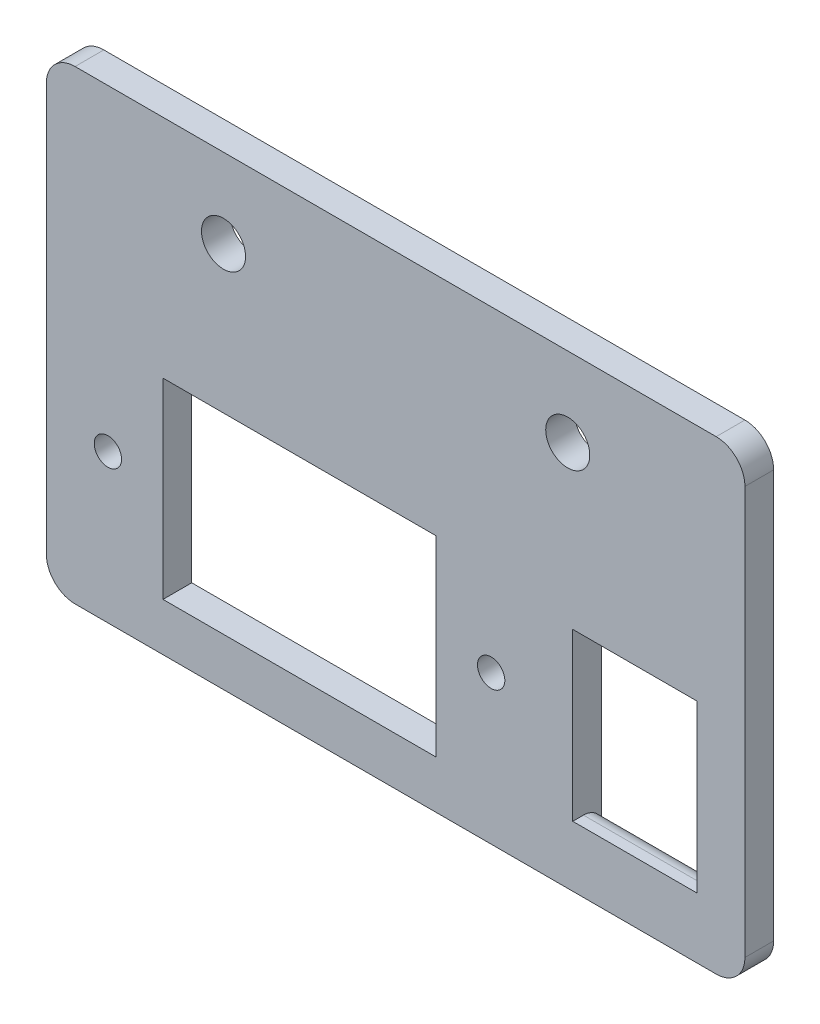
ISO-10303-21;
HEADER;
FILE_DESCRIPTION(('STEP AP214'),'2;1');
FILE_NAME('part.step','',(''),(''),'','','');
FILE_SCHEMA(('AUTOMOTIVE_DESIGN { 1 0 10303 214 1 1 1 1 }'));
ENDSEC;
DATA;
#1=APPLICATION_CONTEXT('core data for automotive mechanical design processes');
#2=APPLICATION_PROTOCOL_DEFINITION('international standard','automotive_design',2000,#1);
#3=PRODUCT_CONTEXT('',#1,'mechanical');
#4=PRODUCT('Part','Part','',(#3));
#5=PRODUCT_RELATED_PRODUCT_CATEGORY('part','',(#4));
#6=PRODUCT_DEFINITION_FORMATION('','',#4);
#7=PRODUCT_DEFINITION_CONTEXT('part definition',#1,'design');
#8=PRODUCT_DEFINITION('design','',#6,#7);
#9=PRODUCT_DEFINITION_SHAPE('','',#8);
#10=(LENGTH_UNIT() NAMED_UNIT(*) SI_UNIT(.MILLI.,.METRE.));
#11=(NAMED_UNIT(*) PLANE_ANGLE_UNIT() SI_UNIT($,.RADIAN.));
#12=(NAMED_UNIT(*) SI_UNIT($,.STERADIAN.) SOLID_ANGLE_UNIT());
#13=UNCERTAINTY_MEASURE_WITH_UNIT(LENGTH_MEASURE(1.E-05),#10,'distance_accuracy_value','');
#14=(GEOMETRIC_REPRESENTATION_CONTEXT(3) GLOBAL_UNCERTAINTY_ASSIGNED_CONTEXT((#13)) GLOBAL_UNIT_ASSIGNED_CONTEXT((#10,
#11,#12)) REPRESENTATION_CONTEXT('',''));
#15=CARTESIAN_POINT('',(0.,0.,0.));
#16=DIRECTION('',(0.,0.,1.));
#17=DIRECTION('',(1.,0.,0.));
#18=AXIS2_PLACEMENT_3D('',#15,#16,#17);
#19=CARTESIAN_POINT('',(0.529206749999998,8.67556,3.));
#20=DIRECTION('',(0.,1.,0.));
#21=DIRECTION('',(0.,0.,1.));
#22=AXIS2_PLACEMENT_3D('',#19,#20,#21);
#23=PLANE('',#22);
#24=DIRECTION('',(0.,0.,-1.));
#25=VECTOR('',#24,1.);
#26=CARTESIAN_POINT('',(19.014999,8.67556,3.));
#27=LINE('',#26,#25);
#28=CARTESIAN_POINT('',(19.014999,8.67556,3.));
#29=VERTEX_POINT('',#28);
#30=CARTESIAN_POINT('',(19.014999,8.67556,1.96442222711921));
#31=VERTEX_POINT('',#30);
#32=EDGE_CURVE('E233',#29,#31,#27,.T.);
#33=ORIENTED_EDGE('',*,*,#32,.T.);
#34=DIRECTION('',(1.,0.,0.));
#35=VECTOR('',#34,1.);
#36=CARTESIAN_POINT('',(0.529206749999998,8.67556,1.96442222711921));
#37=LINE('',#36,#35);
#38=CARTESIAN_POINT('',(31.985001,8.67556,1.96442222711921));
#39=VERTEX_POINT('',#38);
#40=EDGE_CURVE('E207',#31,#39,#37,.T.);
#41=ORIENTED_EDGE('',*,*,#40,.T.);
#42=DIRECTION('',(0.,0.,-1.));
#43=VECTOR('',#42,1.);
#44=CARTESIAN_POINT('',(31.985001,8.67556,3.));
#45=LINE('',#44,#43);
#46=CARTESIAN_POINT('',(31.985001,8.67556,3.));
#47=VERTEX_POINT('',#46);
#48=EDGE_CURVE('E418',#47,#39,#45,.T.);
#49=ORIENTED_EDGE('',*,*,#48,.F.);
#50=DIRECTION('',(1.,0.,0.));
#51=VECTOR('',#50,1.);
#52=CARTESIAN_POINT('',(0.529206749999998,8.67556,3.));
#53=LINE('',#52,#51);
#54=EDGE_CURVE('E276',#29,#47,#53,.T.);
#55=ORIENTED_EDGE('',*,*,#54,.F.);
#56=EDGE_LOOP('',(#33,#41,#49,#55));
#57=FACE_BOUND('',#56,.T.);
#58=ADVANCED_FACE('F35',(#57),#23,.F.);
#59=CARTESIAN_POINT('',(31.985001,-58.9988552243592,3.));
#60=DIRECTION('',(1.,0.,0.));
#61=DIRECTION('',(0.,1.,0.));
#62=AXIS2_PLACEMENT_3D('',#59,#60,#61);
#63=PLANE('',#62);
#64=CARTESIAN_POINT('',(31.985001,10.67556,1.96442222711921));
#65=DIRECTION('',(1.,0.,0.));
#66=DIRECTION('',(0.,1.,0.));
#67=AXIS2_PLACEMENT_3D('',#64,#65,#66);
#68=CIRCLE('',#67,2.);
#69=CARTESIAN_POINT('',(31.985001,10.3,0.));
#70=VERTEX_POINT('',#69);
#71=EDGE_CURVE('E210',#39,#70,#68,.T.);
#72=ORIENTED_EDGE('',*,*,#71,.T.);
#73=DIRECTION('',(0.,-1.,0.));
#74=VECTOR('',#73,1.);
#75=CARTESIAN_POINT('',(31.985001,-58.9988552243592,0.));
#76=LINE('',#75,#74);
#77=CARTESIAN_POINT('',(31.985001,-10.,0.));
#78=VERTEX_POINT('',#77);
#79=EDGE_CURVE('E308',#70,#78,#76,.T.);
#80=ORIENTED_EDGE('',*,*,#79,.T.);
#81=CARTESIAN_POINT('',(31.985001,-10.67556,1.88245018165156));
#82=DIRECTION('',(1.,0.,0.));
#83=DIRECTION('',(0.,1.,0.));
#84=AXIS2_PLACEMENT_3D('',#81,#82,#83);
#85=CIRCLE('',#84,2.);
#86=CARTESIAN_POINT('',(31.985001,-8.67556,1.88245018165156));
#87=VERTEX_POINT('',#86);
#88=EDGE_CURVE('E43',#78,#87,#85,.T.);
#89=ORIENTED_EDGE('',*,*,#88,.T.);
#90=DIRECTION('',(0.,0.,-1.));
#91=VECTOR('',#90,1.);
#92=CARTESIAN_POINT('',(31.985001,-8.67556,3.));
#93=LINE('',#92,#91);
#94=CARTESIAN_POINT('',(31.985001,-8.67556,3.));
#95=VERTEX_POINT('',#94);
#96=EDGE_CURVE('E223',#95,#87,#93,.T.);
#97=ORIENTED_EDGE('',*,*,#96,.F.);
#98=DIRECTION('',(0.,-1.,0.));
#99=VECTOR('',#98,1.);
#100=CARTESIAN_POINT('',(31.985001,-58.9988552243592,3.));
#101=LINE('',#100,#99);
#102=EDGE_CURVE('E279',#47,#95,#101,.T.);
#103=ORIENTED_EDGE('',*,*,#102,.F.);
#104=ORIENTED_EDGE('',*,*,#48,.T.);
#105=EDGE_LOOP('',(#72,#80,#89,#97,#103,#104));
#106=FACE_BOUND('',#105,.T.);
#107=ADVANCED_FACE('F342',(#106),#63,.F.);
#108=CARTESIAN_POINT('',(0.529206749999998,-8.67556,3.));
#109=DIRECTION('',(0.,1.,0.));
#110=DIRECTION('',(0.,0.,1.));
#111=AXIS2_PLACEMENT_3D('',#108,#109,#110);
#112=PLANE('',#111);
#113=ORIENTED_EDGE('',*,*,#96,.T.);
#114=DIRECTION('',(1.,0.,0.));
#115=VECTOR('',#114,1.);
#116=CARTESIAN_POINT('',(19.014999,-8.67556,1.88245018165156));
#117=LINE('',#116,#115);
#118=CARTESIAN_POINT('',(19.014999,-8.67556,1.88245018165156));
#119=VERTEX_POINT('',#118);
#120=EDGE_CURVE('E215',#87,#119,#117,.F.);
#121=ORIENTED_EDGE('',*,*,#120,.T.);
#122=DIRECTION('',(0.,0.,-1.));
#123=VECTOR('',#122,1.);
#124=CARTESIAN_POINT('',(19.014999,-8.67556,3.));
#125=LINE('',#124,#123);
#126=CARTESIAN_POINT('',(19.014999,-8.67556,3.));
#127=VERTEX_POINT('',#126);
#128=EDGE_CURVE('E221',#127,#119,#125,.T.);
#129=ORIENTED_EDGE('',*,*,#128,.F.);
#130=DIRECTION('',(1.,0.,0.));
#131=VECTOR('',#130,1.);
#132=CARTESIAN_POINT('',(0.529206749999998,-8.67556,3.));
#133=LINE('',#132,#131);
#134=EDGE_CURVE('E281',#127,#95,#133,.T.);
#135=ORIENTED_EDGE('',*,*,#134,.T.);
#136=EDGE_LOOP('',(#113,#121,#129,#135));
#137=FACE_BOUND('',#136,.T.);
#138=ADVANCED_FACE('F219',(#137),#112,.T.);
#139=CARTESIAN_POINT('',(0.529206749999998,9.99999999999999,3.));
#140=DIRECTION('',(0.,1.,0.));
#141=DIRECTION('',(0.,0.,1.));
#142=AXIS2_PLACEMENT_3D('',#139,#140,#141);
#143=PLANE('',#142);
#144=DIRECTION('',(1.,0.,0.));
#145=VECTOR('',#144,1.);
#146=CARTESIAN_POINT('',(0.529206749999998,9.99999999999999,0.));
#147=LINE('',#146,#145);
#148=CARTESIAN_POINT('',(-23.75,9.99999999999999,0.));
#149=VERTEX_POINT('',#148);
#150=CARTESIAN_POINT('',(4.75,9.99999999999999,0.));
#151=VERTEX_POINT('',#150);
#152=EDGE_CURVE('E428',#149,#151,#147,.T.);
#153=ORIENTED_EDGE('',*,*,#152,.T.);
#154=DIRECTION('',(0.,0.,-1.));
#155=VECTOR('',#154,1.);
#156=CARTESIAN_POINT('',(4.75,9.99999999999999,3.));
#157=LINE('',#156,#155);
#158=CARTESIAN_POINT('',(4.75,9.99999999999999,3.));
#159=VERTEX_POINT('',#158);
#160=EDGE_CURVE('E409',#159,#151,#157,.T.);
#161=ORIENTED_EDGE('',*,*,#160,.F.);
#162=DIRECTION('',(1.,0.,0.));
#163=VECTOR('',#162,1.);
#164=CARTESIAN_POINT('',(0.529206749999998,9.99999999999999,3.));
#165=LINE('',#164,#163);
#166=CARTESIAN_POINT('',(-23.75,9.99999999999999,3.));
#167=VERTEX_POINT('',#166);
#168=EDGE_CURVE('E265',#167,#159,#165,.T.);
#169=ORIENTED_EDGE('',*,*,#168,.F.);
#170=DIRECTION('',(0.,0.,-1.));
#171=VECTOR('',#170,1.);
#172=CARTESIAN_POINT('',(-23.75,9.99999999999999,3.));
#173=LINE('',#172,#171);
#174=EDGE_CURVE('E284',#167,#149,#173,.T.);
#175=ORIENTED_EDGE('',*,*,#174,.T.);
#176=EDGE_LOOP('',(#153,#161,#169,#175));
#177=FACE_BOUND('',#176,.T.);
#178=ADVANCED_FACE('F365',(#177),#143,.F.);
#179=CARTESIAN_POINT('',(4.75000000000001,-58.9988552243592,3.));
#180=DIRECTION('',(1.,0.,0.));
#181=DIRECTION('',(0.,1.,0.));
#182=AXIS2_PLACEMENT_3D('',#179,#180,#181);
#183=PLANE('',#182);
#184=DIRECTION('',(0.,-1.,0.));
#185=VECTOR('',#184,1.);
#186=CARTESIAN_POINT('',(4.75000000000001,-58.9988552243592,0.));
#187=LINE('',#186,#185);
#188=CARTESIAN_POINT('',(4.75,-10.,0.));
#189=VERTEX_POINT('',#188);
#190=EDGE_CURVE('E433',#151,#189,#187,.T.);
#191=ORIENTED_EDGE('',*,*,#190,.T.);
#192=DIRECTION('',(0.,0.,-1.));
#193=VECTOR('',#192,1.);
#194=CARTESIAN_POINT('',(4.75,-10.,3.));
#195=LINE('',#194,#193);
#196=CARTESIAN_POINT('',(4.75,-10.,3.));
#197=VERTEX_POINT('',#196);
#198=EDGE_CURVE('E412',#197,#189,#195,.T.);
#199=ORIENTED_EDGE('',*,*,#198,.F.);
#200=DIRECTION('',(0.,-1.,0.));
#201=VECTOR('',#200,1.);
#202=CARTESIAN_POINT('',(4.75000000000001,-58.9988552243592,3.));
#203=LINE('',#202,#201);
#204=EDGE_CURVE('E268',#159,#197,#203,.T.);
#205=ORIENTED_EDGE('',*,*,#204,.F.);
#206=ORIENTED_EDGE('',*,*,#160,.T.);
#207=EDGE_LOOP('',(#191,#199,#205,#206));
#208=FACE_BOUND('',#207,.T.);
#209=ADVANCED_FACE('F361',(#208),#183,.F.);
#210=CARTESIAN_POINT('',(0.529206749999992,-10.,3.));
#211=DIRECTION('',(0.,1.,0.));
#212=DIRECTION('',(-1.,0.,0.));
#213=AXIS2_PLACEMENT_3D('',#210,#211,#212);
#214=PLANE('',#213);
#215=DIRECTION('',(1.,0.,0.));
#216=VECTOR('',#215,1.);
#217=CARTESIAN_POINT('',(0.529206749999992,-10.,0.));
#218=LINE('',#217,#216);
#219=CARTESIAN_POINT('',(-23.75,-10.,0.));
#220=VERTEX_POINT('',#219);
#221=EDGE_CURVE('E170',#220,#189,#218,.T.);
#222=ORIENTED_EDGE('',*,*,#221,.F.);
#223=DIRECTION('',(0.,0.,-1.));
#224=VECTOR('',#223,1.);
#225=CARTESIAN_POINT('',(-23.75,-10.,3.));
#226=LINE('',#225,#224);
#227=CARTESIAN_POINT('',(-23.75,-10.,3.));
#228=VERTEX_POINT('',#227);
#229=EDGE_CURVE('E422',#228,#220,#226,.T.);
#230=ORIENTED_EDGE('',*,*,#229,.F.);
#231=DIRECTION('',(1.,0.,0.));
#232=VECTOR('',#231,1.);
#233=CARTESIAN_POINT('',(0.529206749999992,-10.,3.));
#234=LINE('',#233,#232);
#235=EDGE_CURVE('E270',#228,#197,#234,.T.);
#236=ORIENTED_EDGE('',*,*,#235,.T.);
#237=ORIENTED_EDGE('',*,*,#198,.T.);
#238=EDGE_LOOP('',(#222,#230,#236,#237));
#239=FACE_BOUND('',#238,.T.);
#240=ADVANCED_FACE('F358',(#239),#214,.T.);
#241=CARTESIAN_POINT('',(36.985001,-58.9988552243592,3.));
#242=DIRECTION('',(1.,0.,0.));
#243=DIRECTION('',(0.,0.,-1.));
#244=AXIS2_PLACEMENT_3D('',#241,#242,#243);
#245=PLANE('',#244);
#246=DIRECTION('',(0.,0.,-1.));
#247=VECTOR('',#246,1.);
#248=CARTESIAN_POINT('',(36.985001,-12.,3.));
#249=LINE('',#248,#247);
#250=CARTESIAN_POINT('',(36.985001,-12.,3.));
#251=VERTEX_POINT('',#250);
#252=CARTESIAN_POINT('',(36.985001,-12.,0.));
#253=VERTEX_POINT('',#252);
#254=EDGE_CURVE('E189',#251,#253,#249,.T.);
#255=ORIENTED_EDGE('',*,*,#254,.T.);
#256=DIRECTION('',(0.,-1.,0.));
#257=VECTOR('',#256,1.);
#258=CARTESIAN_POINT('',(36.985001,-58.9988552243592,0.));
#259=LINE('',#258,#257);
#260=CARTESIAN_POINT('',(36.985001,30.5776,0.));
#261=VERTEX_POINT('',#260);
#262=EDGE_CURVE('E50',#261,#253,#259,.T.);
#263=ORIENTED_EDGE('',*,*,#262,.F.);
#264=DIRECTION('',(0.,0.,-1.));
#265=VECTOR('',#264,1.);
#266=CARTESIAN_POINT('',(36.985001,30.5776,3.));
#267=LINE('',#266,#265);
#268=CARTESIAN_POINT('',(36.985001,30.5776,3.));
#269=VERTEX_POINT('',#268);
#270=EDGE_CURVE('E298',#261,#269,#267,.F.);
#271=ORIENTED_EDGE('',*,*,#270,.T.);
#272=DIRECTION('',(0.,-1.,0.));
#273=VECTOR('',#272,1.);
#274=CARTESIAN_POINT('',(36.985001,-58.9988552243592,3.));
#275=LINE('',#274,#273);
#276=EDGE_CURVE('E255',#269,#251,#275,.T.);
#277=ORIENTED_EDGE('',*,*,#276,.T.);
#278=EDGE_LOOP('',(#255,#263,#271,#277));
#279=FACE_BOUND('',#278,.T.);
#280=ADVANCED_FACE('F302',(#279),#245,.T.);
#281=CARTESIAN_POINT('',(0.529206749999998,33.5776,3.));
#282=DIRECTION('',(0.,1.,0.));
#283=DIRECTION('',(0.,0.,1.));
#284=AXIS2_PLACEMENT_3D('',#281,#282,#283);
#285=PLANE('',#284);
#286=DIRECTION('',(1.,0.,0.));
#287=VECTOR('',#286,1.);
#288=CARTESIAN_POINT('',(0.529206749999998,33.5776,3.));
#289=LINE('',#288,#287);
#290=CARTESIAN_POINT('',(-32.9265875,33.5776,3.));
#291=VERTEX_POINT('',#290);
#292=CARTESIAN_POINT('',(33.985001,33.5776,3.));
#293=VERTEX_POINT('',#292);
#294=EDGE_CURVE('E258',#291,#293,#289,.T.);
#295=ORIENTED_EDGE('',*,*,#294,.T.);
#296=DIRECTION('',(0.,0.,-1.));
#297=VECTOR('',#296,1.);
#298=CARTESIAN_POINT('',(33.985001,33.5776,3.));
#299=LINE('',#298,#297);
#300=CARTESIAN_POINT('',(33.985001,33.5776,0.));
#301=VERTEX_POINT('',#300);
#302=EDGE_CURVE('E200',#293,#301,#299,.T.);
#303=ORIENTED_EDGE('',*,*,#302,.T.);
#304=DIRECTION('',(1.,0.,0.));
#305=VECTOR('',#304,1.);
#306=CARTESIAN_POINT('',(0.529206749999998,33.5776,0.));
#307=LINE('',#306,#305);
#308=CARTESIAN_POINT('',(-32.9265875,33.5776,0.));
#309=VERTEX_POINT('',#308);
#310=EDGE_CURVE('E292',#309,#301,#307,.T.);
#311=ORIENTED_EDGE('',*,*,#310,.F.);
#312=DIRECTION('',(0.,0.,-1.));
#313=VECTOR('',#312,1.);
#314=CARTESIAN_POINT('',(-32.9265875,33.5776,3.));
#315=LINE('',#314,#313);
#316=EDGE_CURVE('E198',#309,#291,#315,.F.);
#317=ORIENTED_EDGE('',*,*,#316,.T.);
#318=EDGE_LOOP('',(#295,#303,#311,#317));
#319=FACE_BOUND('',#318,.T.);
#320=ADVANCED_FACE('F375',(#319),#285,.T.);
#321=CARTESIAN_POINT('',(-35.9265875,-58.9988552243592,3.));
#322=DIRECTION('',(-1.,0.,0.));
#323=DIRECTION('',(0.,0.,1.));
#324=AXIS2_PLACEMENT_3D('',#321,#322,#323);
#325=PLANE('',#324);
#326=DIRECTION('',(0.,1.,0.));
#327=VECTOR('',#326,1.);
#328=CARTESIAN_POINT('',(-35.9265875,-58.9988552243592,0.));
#329=LINE('',#328,#327);
#330=CARTESIAN_POINT('',(-35.9265875,-12.,0.));
#331=VERTEX_POINT('',#330);
#332=CARTESIAN_POINT('',(-35.9265875,30.5776,0.));
#333=VERTEX_POINT('',#332);
#334=EDGE_CURVE('E427',#331,#333,#329,.T.);
#335=ORIENTED_EDGE('',*,*,#334,.F.);
#336=DIRECTION('',(0.,0.,-1.));
#337=VECTOR('',#336,1.);
#338=CARTESIAN_POINT('',(-35.9265875,-12.,3.));
#339=LINE('',#338,#337);
#340=CARTESIAN_POINT('',(-35.9265875,-12.,3.));
#341=VERTEX_POINT('',#340);
#342=EDGE_CURVE('E177',#331,#341,#339,.F.);
#343=ORIENTED_EDGE('',*,*,#342,.T.);
#344=DIRECTION('',(0.,1.,0.));
#345=VECTOR('',#344,1.);
#346=CARTESIAN_POINT('',(-35.9265875,-58.9988552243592,3.));
#347=LINE('',#346,#345);
#348=CARTESIAN_POINT('',(-35.9265875,30.5776,3.));
#349=VERTEX_POINT('',#348);
#350=EDGE_CURVE('E261',#341,#349,#347,.T.);
#351=ORIENTED_EDGE('',*,*,#350,.T.);
#352=DIRECTION('',(0.,0.,-1.));
#353=VECTOR('',#352,1.);
#354=CARTESIAN_POINT('',(-35.9265875,30.5776,3.));
#355=LINE('',#354,#353);
#356=EDGE_CURVE('E420',#349,#333,#355,.T.);
#357=ORIENTED_EDGE('',*,*,#356,.T.);
#358=EDGE_LOOP('',(#335,#343,#351,#357));
#359=FACE_BOUND('',#358,.T.);
#360=ADVANCED_FACE('F356',(#359),#325,.T.);
#361=CARTESIAN_POINT('',(-23.75,-58.9988552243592,3.));
#362=DIRECTION('',(1.,0.,0.));
#363=DIRECTION('',(0.,0.,-1.));
#364=AXIS2_PLACEMENT_3D('',#361,#362,#363);
#365=PLANE('',#364);
#366=DIRECTION('',(0.,-1.,0.));
#367=VECTOR('',#366,1.);
#368=CARTESIAN_POINT('',(-23.75,-58.9988552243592,0.));
#369=LINE('',#368,#367);
#370=EDGE_CURVE('E435',#149,#220,#369,.T.);
#371=ORIENTED_EDGE('',*,*,#370,.F.);
#372=ORIENTED_EDGE('',*,*,#174,.F.);
#373=DIRECTION('',(0.,-1.,0.));
#374=VECTOR('',#373,1.);
#375=CARTESIAN_POINT('',(-23.75,-58.9988552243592,3.));
#376=LINE('',#375,#374);
#377=EDGE_CURVE('E273',#167,#228,#376,.T.);
#378=ORIENTED_EDGE('',*,*,#377,.T.);
#379=ORIENTED_EDGE('',*,*,#229,.T.);
#380=EDGE_LOOP('',(#371,#372,#378,#379));
#381=FACE_BOUND('',#380,.T.);
#382=ADVANCED_FACE('F353',(#381),#365,.T.);
#383=CARTESIAN_POINT('',(0.529206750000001,-15.,3.));
#384=DIRECTION('',(0.,-1.,0.));
#385=DIRECTION('',(1.,0.,0.));
#386=AXIS2_PLACEMENT_3D('',#383,#384,#385);
#387=PLANE('',#386);
#388=DIRECTION('',(1.,0.,0.));
#389=VECTOR('',#388,1.);
#390=CARTESIAN_POINT('',(-40.014999,-15.,0.));
#391=LINE('',#390,#389);
#392=CARTESIAN_POINT('',(-32.9265875,-15.,0.));
#393=VERTEX_POINT('',#392);
#394=CARTESIAN_POINT('',(33.985001,-15.,0.));
#395=VERTEX_POINT('',#394);
#396=EDGE_CURVE('E160',#393,#395,#391,.T.);
#397=ORIENTED_EDGE('',*,*,#396,.T.);
#398=DIRECTION('',(0.,0.,-1.));
#399=VECTOR('',#398,1.);
#400=CARTESIAN_POINT('',(33.985001,-15.,3.));
#401=LINE('',#400,#399);
#402=CARTESIAN_POINT('',(33.985001,-15.,3.));
#403=VERTEX_POINT('',#402);
#404=EDGE_CURVE('E185',#395,#403,#401,.F.);
#405=ORIENTED_EDGE('',*,*,#404,.T.);
#406=DIRECTION('',(-1.,0.,0.));
#407=VECTOR('',#406,1.);
#408=CARTESIAN_POINT('',(0.529206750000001,-15.,3.));
#409=LINE('',#408,#407);
#410=CARTESIAN_POINT('',(-32.9265875,-15.,3.));
#411=VERTEX_POINT('',#410);
#412=EDGE_CURVE('E183',#403,#411,#409,.T.);
#413=ORIENTED_EDGE('',*,*,#412,.T.);
#414=DIRECTION('',(0.,0.,-1.));
#415=VECTOR('',#414,1.);
#416=CARTESIAN_POINT('',(-32.9265875,-15.,3.));
#417=LINE('',#416,#415);
#418=EDGE_CURVE('E176',#411,#393,#417,.T.);
#419=ORIENTED_EDGE('',*,*,#418,.T.);
#420=EDGE_LOOP('',(#397,#405,#413,#419));
#421=FACE_BOUND('',#420,.T.);
#422=ADVANCED_FACE('F181',(#421),#387,.T.);
#423=CARTESIAN_POINT('',(10.5,0.4999975,3.));
#424=DIRECTION('',(0.,0.,-1.));
#425=DIRECTION('',(-1.,0.,0.));
#426=AXIS2_PLACEMENT_3D('',#423,#424,#425);
#427=CYLINDRICAL_SURFACE('',#426,1.4265825);
#428=CARTESIAN_POINT('',(10.5,0.4999975,3.));
#429=DIRECTION('',(0.,0.,1.));
#430=DIRECTION('',(1.,0.,0.));
#431=AXIS2_PLACEMENT_3D('',#428,#429,#430);
#432=CIRCLE('',#431,1.4265825);
#433=CARTESIAN_POINT('',(11.9265825,0.4999975,3.));
#434=VERTEX_POINT('',#433);
#435=EDGE_CURVE('E251',#434,#434,#432,.T.);
#436=ORIENTED_EDGE('',*,*,#435,.T.);
#437=EDGE_LOOP('',(#436));
#438=FACE_BOUND('',#437,.T.);
#439=CARTESIAN_POINT('',(10.5,0.4999975,0.));
#440=DIRECTION('',(0.,0.,1.));
#441=DIRECTION('',(1.,0.,0.));
#442=AXIS2_PLACEMENT_3D('',#439,#440,#441);
#443=CIRCLE('',#442,1.4265825);
#444=CARTESIAN_POINT('',(11.9265825,0.4999975,0.));
#445=VERTEX_POINT('',#444);
#446=EDGE_CURVE('E287',#445,#445,#443,.T.);
#447=ORIENTED_EDGE('',*,*,#446,.F.);
#448=EDGE_LOOP('',(#447));
#449=FACE_BOUND('',#448,.T.);
#450=ADVANCED_FACE('F372',(#438,#449),#427,.F.);
#451=CARTESIAN_POINT('',(-29.5,0.5000025,3.));
#452=DIRECTION('',(0.,0.,-1.));
#453=DIRECTION('',(-1.,0.,0.));
#454=AXIS2_PLACEMENT_3D('',#451,#452,#453);
#455=CYLINDRICAL_SURFACE('',#454,1.4265875);
#456=CARTESIAN_POINT('',(-29.5,0.5000025,3.));
#457=DIRECTION('',(0.,0.,1.));
#458=DIRECTION('',(1.,0.,0.));
#459=AXIS2_PLACEMENT_3D('',#456,#457,#458);
#460=CIRCLE('',#459,1.4265875);
#461=CARTESIAN_POINT('',(-28.0734125,0.5000025,3.));
#462=VERTEX_POINT('',#461);
#463=EDGE_CURVE('E248',#462,#462,#460,.T.);
#464=ORIENTED_EDGE('',*,*,#463,.T.);
#465=EDGE_LOOP('',(#464));
#466=FACE_BOUND('',#465,.T.);
#467=CARTESIAN_POINT('',(-29.5,0.5000025,0.));
#468=DIRECTION('',(0.,0.,1.));
#469=DIRECTION('',(1.,0.,0.));
#470=AXIS2_PLACEMENT_3D('',#467,#468,#469);
#471=CIRCLE('',#470,1.4265875);
#472=CARTESIAN_POINT('',(-28.0734125,0.5000025,0.));
#473=VERTEX_POINT('',#472);
#474=EDGE_CURVE('E241',#473,#473,#471,.T.);
#475=ORIENTED_EDGE('',*,*,#474,.F.);
#476=EDGE_LOOP('',(#475));
#477=FACE_BOUND('',#476,.T.);
#478=ADVANCED_FACE('F384',(#466,#477),#455,.F.);
#479=CARTESIAN_POINT('',(19.014999,-58.9988552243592,3.));
#480=DIRECTION('',(1.,0.,0.));
#481=DIRECTION('',(0.,1.,0.));
#482=AXIS2_PLACEMENT_3D('',#479,#480,#481);
#483=PLANE('',#482);
#484=DIRECTION('',(0.,-1.,0.));
#485=VECTOR('',#484,1.);
#486=CARTESIAN_POINT('',(19.014999,-58.9988552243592,0.));
#487=LINE('',#486,#485);
#488=CARTESIAN_POINT('',(19.014999,10.3,0.));
#489=VERTEX_POINT('',#488);
#490=CARTESIAN_POINT('',(19.014999,-10.,0.));
#491=VERTEX_POINT('',#490);
#492=EDGE_CURVE('E252',#489,#491,#487,.T.);
#493=ORIENTED_EDGE('',*,*,#492,.F.);
#494=CARTESIAN_POINT('',(19.014999,10.67556,1.96442222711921));
#495=DIRECTION('',(1.,0.,0.));
#496=DIRECTION('',(0.,1.,0.));
#497=AXIS2_PLACEMENT_3D('',#494,#495,#496);
#498=CIRCLE('',#497,2.);
#499=EDGE_CURVE('E213',#489,#31,#498,.F.);
#500=ORIENTED_EDGE('',*,*,#499,.T.);
#501=ORIENTED_EDGE('',*,*,#32,.F.);
#502=DIRECTION('',(0.,-1.,0.));
#503=VECTOR('',#502,1.);
#504=CARTESIAN_POINT('',(19.014999,-58.9988552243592,3.));
#505=LINE('',#504,#503);
#506=EDGE_CURVE('E232',#29,#127,#505,.T.);
#507=ORIENTED_EDGE('',*,*,#506,.T.);
#508=ORIENTED_EDGE('',*,*,#128,.T.);
#509=CARTESIAN_POINT('',(19.014999,-10.67556,1.88245018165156));
#510=DIRECTION('',(1.,0.,0.));
#511=DIRECTION('',(0.,1.,0.));
#512=AXIS2_PLACEMENT_3D('',#509,#510,#511);
#513=CIRCLE('',#512,2.);
#514=EDGE_CURVE('E11',#119,#491,#513,.F.);
#515=ORIENTED_EDGE('',*,*,#514,.T.);
#516=EDGE_LOOP('',(#493,#500,#501,#507,#508,#515));
#517=FACE_BOUND('',#516,.T.);
#518=ADVANCED_FACE('F229',(#517),#483,.T.);
#519=CARTESIAN_POINT('',(0.529206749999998,-58.9988552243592,3.));
#520=DIRECTION('',(0.,0.,1.));
#521=DIRECTION('',(1.,0.,0.));
#522=AXIS2_PLACEMENT_3D('',#519,#520,#521);
#523=PLANE('',#522);
#524=CARTESIAN_POINT('',(-17.434087,25.3,3.));
#525=DIRECTION('',(0.,0.,-1.));
#526=DIRECTION('',(1.,0.,0.));
#527=AXIS2_PLACEMENT_3D('',#524,#525,#526);
#528=CIRCLE('',#527,2.3);
#529=CARTESIAN_POINT('',(-15.134087,25.3,3.));
#530=VERTEX_POINT('',#529);
#531=EDGE_CURVE('E313',#530,#530,#528,.T.);
#532=ORIENTED_EDGE('',*,*,#531,.T.);
#533=EDGE_LOOP('',(#532));
#534=FACE_BOUND('',#533,.T.);
#535=CARTESIAN_POINT('',(18.4925005,25.3,3.));
#536=DIRECTION('',(0.,0.,-1.));
#537=DIRECTION('',(-1.,0.,0.));
#538=AXIS2_PLACEMENT_3D('',#535,#536,#537);
#539=CIRCLE('',#538,2.3);
#540=CARTESIAN_POINT('',(16.1925005,25.3,3.));
#541=VERTEX_POINT('',#540);
#542=EDGE_CURVE('E238',#541,#541,#539,.T.);
#543=ORIENTED_EDGE('',*,*,#542,.T.);
#544=EDGE_LOOP('',(#543));
#545=FACE_BOUND('',#544,.T.);
#546=ORIENTED_EDGE('',*,*,#463,.F.);
#547=EDGE_LOOP('',(#546));
#548=FACE_BOUND('',#547,.T.);
#549=ORIENTED_EDGE('',*,*,#435,.F.);
#550=EDGE_LOOP('',(#549));
#551=FACE_BOUND('',#550,.T.);
#552=ORIENTED_EDGE('',*,*,#350,.F.);
#553=CARTESIAN_POINT('',(-32.9265875,-12.,3.));
#554=DIRECTION('',(0.,0.,1.));
#555=DIRECTION('',(1.,0.,0.));
#556=AXIS2_PLACEMENT_3D('',#553,#554,#555);
#557=CIRCLE('',#556,3.);
#558=EDGE_CURVE('E196',#341,#411,#557,.T.);
#559=ORIENTED_EDGE('',*,*,#558,.T.);
#560=ORIENTED_EDGE('',*,*,#412,.F.);
#561=CARTESIAN_POINT('',(33.985001,-12.,3.));
#562=DIRECTION('',(0.,0.,1.));
#563=DIRECTION('',(1.,0.,0.));
#564=AXIS2_PLACEMENT_3D('',#561,#562,#563);
#565=CIRCLE('',#564,3.);
#566=EDGE_CURVE('E194',#403,#251,#565,.T.);
#567=ORIENTED_EDGE('',*,*,#566,.T.);
#568=ORIENTED_EDGE('',*,*,#276,.F.);
#569=CARTESIAN_POINT('',(33.985001,30.5776,3.));
#570=DIRECTION('',(0.,0.,1.));
#571=DIRECTION('',(1.,0.,0.));
#572=AXIS2_PLACEMENT_3D('',#569,#570,#571);
#573=CIRCLE('',#572,3.);
#574=EDGE_CURVE('E187',#269,#293,#573,.T.);
#575=ORIENTED_EDGE('',*,*,#574,.T.);
#576=ORIENTED_EDGE('',*,*,#294,.F.);
#577=CARTESIAN_POINT('',(-32.9265875,30.5776,3.));
#578=DIRECTION('',(0.,0.,1.));
#579=DIRECTION('',(1.,0.,0.));
#580=AXIS2_PLACEMENT_3D('',#577,#578,#579);
#581=CIRCLE('',#580,3.);
#582=EDGE_CURVE('E184',#291,#349,#581,.T.);
#583=ORIENTED_EDGE('',*,*,#582,.T.);
#584=EDGE_LOOP('',(#552,#559,#560,#567,#568,#575,#576,#583));
#585=FACE_BOUND('',#584,.T.);
#586=ORIENTED_EDGE('',*,*,#168,.T.);
#587=ORIENTED_EDGE('',*,*,#204,.T.);
#588=ORIENTED_EDGE('',*,*,#235,.F.);
#589=ORIENTED_EDGE('',*,*,#377,.F.);
#590=EDGE_LOOP('',(#586,#587,#588,#589));
#591=FACE_BOUND('',#590,.T.);
#592=ORIENTED_EDGE('',*,*,#54,.T.);
#593=ORIENTED_EDGE('',*,*,#102,.T.);
#594=ORIENTED_EDGE('',*,*,#134,.F.);
#595=ORIENTED_EDGE('',*,*,#506,.F.);
#596=EDGE_LOOP('',(#592,#593,#594,#595));
#597=FACE_BOUND('',#596,.T.);
#598=ADVANCED_FACE('F323',(#534,#545,#548,#551,#585,#591,#597),#523,.T.);
#599=CARTESIAN_POINT('',(0.529206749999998,-58.9988552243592,0.));
#600=DIRECTION('',(0.,0.,1.));
#601=DIRECTION('',(1.,0.,0.));
#602=AXIS2_PLACEMENT_3D('',#599,#600,#601);
#603=PLANE('',#602);
#604=DIRECTION('',(1.,0.,0.));
#605=VECTOR('',#604,1.);
#606=CARTESIAN_POINT('',(33.985001,10.3,0.));
#607=LINE('',#606,#605);
#608=EDGE_CURVE('E237',#489,#70,#607,.T.);
#609=ORIENTED_EDGE('',*,*,#608,.F.);
#610=ORIENTED_EDGE('',*,*,#492,.T.);
#611=DIRECTION('',(-1.,0.,0.));
#612=VECTOR('',#611,1.);
#613=CARTESIAN_POINT('',(-67.7584484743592,-10.,0.));
#614=LINE('',#613,#612);
#615=EDGE_CURVE('E235',#78,#491,#614,.T.);
#616=ORIENTED_EDGE('',*,*,#615,.F.);
#617=ORIENTED_EDGE('',*,*,#79,.F.);
#618=EDGE_LOOP('',(#609,#610,#616,#617));
#619=FACE_BOUND('',#618,.T.);
#620=ORIENTED_EDGE('',*,*,#334,.T.);
#621=CARTESIAN_POINT('',(-32.9265875,30.5776,0.));
#622=DIRECTION('',(0.,0.,1.));
#623=DIRECTION('',(1.,0.,0.));
#624=AXIS2_PLACEMENT_3D('',#621,#622,#623);
#625=CIRCLE('',#624,3.);
#626=EDGE_CURVE('E203',#333,#309,#625,.F.);
#627=ORIENTED_EDGE('',*,*,#626,.T.);
#628=ORIENTED_EDGE('',*,*,#310,.T.);
#629=CARTESIAN_POINT('',(33.985001,30.5776,0.));
#630=DIRECTION('',(0.,0.,1.));
#631=DIRECTION('',(1.,0.,0.));
#632=AXIS2_PLACEMENT_3D('',#629,#630,#631);
#633=CIRCLE('',#632,3.);
#634=EDGE_CURVE('E205',#301,#261,#633,.F.);
#635=ORIENTED_EDGE('',*,*,#634,.T.);
#636=ORIENTED_EDGE('',*,*,#262,.T.);
#637=CARTESIAN_POINT('',(33.985001,-12.,0.));
#638=DIRECTION('',(0.,0.,1.));
#639=DIRECTION('',(1.,0.,0.));
#640=AXIS2_PLACEMENT_3D('',#637,#638,#639);
#641=CIRCLE('',#640,3.);
#642=EDGE_CURVE('E166',#253,#395,#641,.F.);
#643=ORIENTED_EDGE('',*,*,#642,.T.);
#644=ORIENTED_EDGE('',*,*,#396,.F.);
#645=CARTESIAN_POINT('',(-32.9265875,-12.,0.));
#646=DIRECTION('',(0.,0.,1.));
#647=DIRECTION('',(1.,0.,0.));
#648=AXIS2_PLACEMENT_3D('',#645,#646,#647);
#649=CIRCLE('',#648,3.);
#650=EDGE_CURVE('E164',#393,#331,#649,.F.);
#651=ORIENTED_EDGE('',*,*,#650,.T.);
#652=EDGE_LOOP('',(#620,#627,#628,#635,#636,#643,#644,#651));
#653=FACE_BOUND('',#652,.T.);
#654=ORIENTED_EDGE('',*,*,#221,.T.);
#655=ORIENTED_EDGE('',*,*,#190,.F.);
#656=ORIENTED_EDGE('',*,*,#152,.F.);
#657=ORIENTED_EDGE('',*,*,#370,.T.);
#658=EDGE_LOOP('',(#654,#655,#656,#657));
#659=FACE_BOUND('',#658,.T.);
#660=ORIENTED_EDGE('',*,*,#446,.T.);
#661=EDGE_LOOP('',(#660));
#662=FACE_BOUND('',#661,.T.);
#663=ORIENTED_EDGE('',*,*,#474,.T.);
#664=EDGE_LOOP('',(#663));
#665=FACE_BOUND('',#664,.T.);
#666=CARTESIAN_POINT('',(-17.434087,25.3,0.));
#667=DIRECTION('',(0.,0.,-1.));
#668=DIRECTION('',(1.,0.,0.));
#669=AXIS2_PLACEMENT_3D('',#666,#667,#668);
#670=CIRCLE('',#669,2.3);
#671=CARTESIAN_POINT('',(-15.134087,25.3,0.));
#672=VERTEX_POINT('',#671);
#673=EDGE_CURVE('E178',#672,#672,#670,.T.);
#674=ORIENTED_EDGE('',*,*,#673,.F.);
#675=EDGE_LOOP('',(#674));
#676=FACE_BOUND('',#675,.T.);
#677=CARTESIAN_POINT('',(18.4925005,25.3,0.));
#678=DIRECTION('',(0.,0.,-1.));
#679=DIRECTION('',(-1.,0.,0.));
#680=AXIS2_PLACEMENT_3D('',#677,#678,#679);
#681=CIRCLE('',#680,2.3);
#682=CARTESIAN_POINT('',(16.1925005,25.3,0.));
#683=VERTEX_POINT('',#682);
#684=EDGE_CURVE('E244',#683,#683,#681,.T.);
#685=ORIENTED_EDGE('',*,*,#684,.F.);
#686=EDGE_LOOP('',(#685));
#687=FACE_BOUND('',#686,.T.);
#688=ADVANCED_FACE('F162',(#619,#653,#659,#662,#665,#676,#687),#603,.F.);
#689=CARTESIAN_POINT('',(-32.9265875,-12.,3.));
#690=DIRECTION('',(0.,0.,-1.));
#691=DIRECTION('',(-1.,0.,0.));
#692=AXIS2_PLACEMENT_3D('',#689,#690,#691);
#693=CYLINDRICAL_SURFACE('',#692,3.);
#694=ORIENTED_EDGE('',*,*,#650,.F.);
#695=ORIENTED_EDGE('',*,*,#418,.F.);
#696=ORIENTED_EDGE('',*,*,#558,.F.);
#697=ORIENTED_EDGE('',*,*,#342,.F.);
#698=EDGE_LOOP('',(#694,#695,#696,#697));
#699=FACE_BOUND('',#698,.T.);
#700=ADVANCED_FACE('F174',(#699),#693,.T.);
#701=CARTESIAN_POINT('',(33.985001,-12.,3.));
#702=DIRECTION('',(0.,0.,-1.));
#703=DIRECTION('',(-1.,0.,0.));
#704=AXIS2_PLACEMENT_3D('',#701,#702,#703);
#705=CYLINDRICAL_SURFACE('',#704,3.);
#706=ORIENTED_EDGE('',*,*,#642,.F.);
#707=ORIENTED_EDGE('',*,*,#254,.F.);
#708=ORIENTED_EDGE('',*,*,#566,.F.);
#709=ORIENTED_EDGE('',*,*,#404,.F.);
#710=EDGE_LOOP('',(#706,#707,#708,#709));
#711=FACE_BOUND('',#710,.T.);
#712=ADVANCED_FACE('F307',(#711),#705,.T.);
#713=CARTESIAN_POINT('',(33.985001,30.5776,3.));
#714=DIRECTION('',(0.,0.,-1.));
#715=DIRECTION('',(-1.,0.,0.));
#716=AXIS2_PLACEMENT_3D('',#713,#714,#715);
#717=CYLINDRICAL_SURFACE('',#716,3.);
#718=ORIENTED_EDGE('',*,*,#574,.F.);
#719=ORIENTED_EDGE('',*,*,#270,.F.);
#720=ORIENTED_EDGE('',*,*,#634,.F.);
#721=ORIENTED_EDGE('',*,*,#302,.F.);
#722=EDGE_LOOP('',(#718,#719,#720,#721));
#723=FACE_BOUND('',#722,.T.);
#724=ADVANCED_FACE('F393',(#723),#717,.T.);
#725=CARTESIAN_POINT('',(-32.9265875,30.5776,3.));
#726=DIRECTION('',(0.,0.,-1.));
#727=DIRECTION('',(-1.,0.,0.));
#728=AXIS2_PLACEMENT_3D('',#725,#726,#727);
#729=CYLINDRICAL_SURFACE('',#728,3.);
#730=ORIENTED_EDGE('',*,*,#582,.F.);
#731=ORIENTED_EDGE('',*,*,#316,.F.);
#732=ORIENTED_EDGE('',*,*,#626,.F.);
#733=ORIENTED_EDGE('',*,*,#356,.F.);
#734=EDGE_LOOP('',(#730,#731,#732,#733));
#735=FACE_BOUND('',#734,.T.);
#736=ADVANCED_FACE('F396',(#735),#729,.T.);
#737=CARTESIAN_POINT('',(0.529206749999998,10.67556,1.96442222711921));
#738=DIRECTION('',(1.,0.,0.));
#739=DIRECTION('',(0.,0.,-1.));
#740=AXIS2_PLACEMENT_3D('',#737,#738,#739);
#741=CYLINDRICAL_SURFACE('',#740,2.);
#742=ORIENTED_EDGE('',*,*,#499,.F.);
#743=ORIENTED_EDGE('',*,*,#608,.T.);
#744=ORIENTED_EDGE('',*,*,#71,.F.);
#745=ORIENTED_EDGE('',*,*,#40,.F.);
#746=EDGE_LOOP('',(#742,#743,#744,#745));
#747=FACE_BOUND('',#746,.T.);
#748=ADVANCED_FACE('F338',(#747),#741,.T.);
#749=CARTESIAN_POINT('',(0.529206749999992,-10.67556,1.88245018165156));
#750=DIRECTION('',(-1.,0.,0.));
#751=DIRECTION('',(0.,-1.,0.));
#752=AXIS2_PLACEMENT_3D('',#749,#750,#751);
#753=CYLINDRICAL_SURFACE('',#752,2.);
#754=ORIENTED_EDGE('',*,*,#514,.F.);
#755=ORIENTED_EDGE('',*,*,#120,.F.);
#756=ORIENTED_EDGE('',*,*,#88,.F.);
#757=ORIENTED_EDGE('',*,*,#615,.T.);
#758=EDGE_LOOP('',(#754,#755,#756,#757));
#759=FACE_BOUND('',#758,.T.);
#760=ADVANCED_FACE('F37',(#759),#753,.T.);
#761=CARTESIAN_POINT('',(18.4925005,25.3,3.));
#762=DIRECTION('',(0.,0.,-1.));
#763=DIRECTION('',(-1.,0.,0.));
#764=AXIS2_PLACEMENT_3D('',#761,#762,#763);
#765=CYLINDRICAL_SURFACE('',#764,2.3);
#766=ORIENTED_EDGE('',*,*,#542,.F.);
#767=EDGE_LOOP('',(#766));
#768=FACE_BOUND('',#767,.T.);
#769=ORIENTED_EDGE('',*,*,#684,.T.);
#770=EDGE_LOOP('',(#769));
#771=FACE_BOUND('',#770,.T.);
#772=ADVANCED_FACE('F328',(#768,#771),#765,.F.);
#773=CARTESIAN_POINT('',(-17.434087,25.3,3.));
#774=DIRECTION('',(0.,0.,-1.));
#775=DIRECTION('',(-1.,0.,0.));
#776=AXIS2_PLACEMENT_3D('',#773,#774,#775);
#777=CYLINDRICAL_SURFACE('',#776,2.3);
#778=ORIENTED_EDGE('',*,*,#531,.F.);
#779=EDGE_LOOP('',(#778));
#780=FACE_BOUND('',#779,.T.);
#781=ORIENTED_EDGE('',*,*,#673,.T.);
#782=EDGE_LOOP('',(#781));
#783=FACE_BOUND('',#782,.T.);
#784=ADVANCED_FACE('F319',(#780,#783),#777,.F.);
#785=CLOSED_SHELL('',(#58,#107,#138,#178,#209,#240,#280,#320,#360,#382,#422,#450,#478,#518,#598,
#688,#700,#712,#724,#736,#748,#760,#772,#784));
#786=MANIFOLD_SOLID_BREP('B2',#785);
#787=ADVANCED_BREP_SHAPE_REPRESENTATION('',(#18,#786),#14);
#788=SHAPE_DEFINITION_REPRESENTATION(#9,#787);
ENDSEC;
END-ISO-10303-21;
